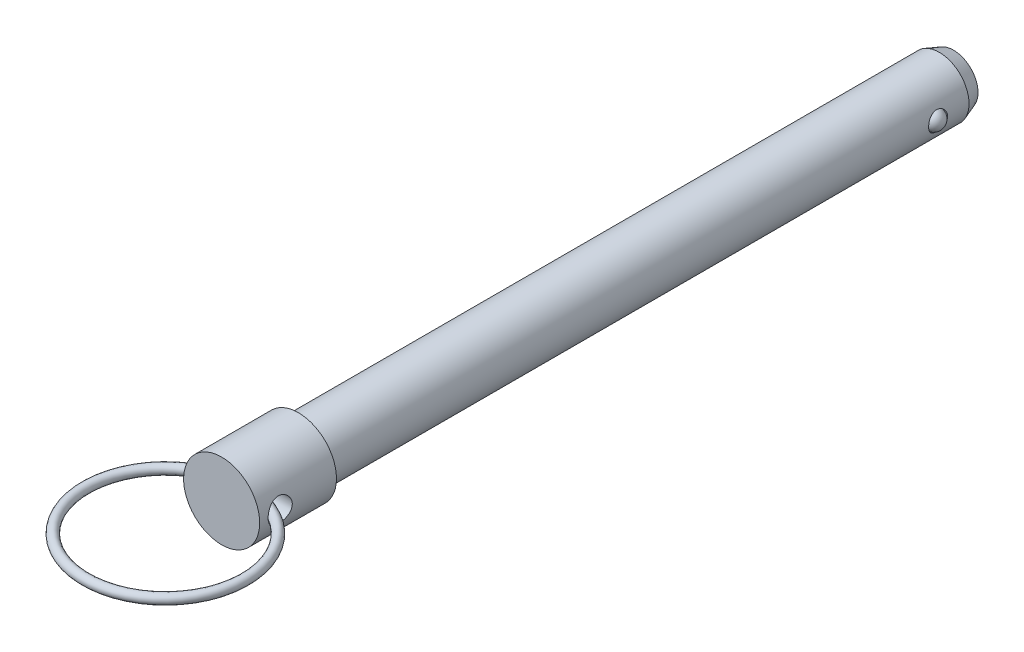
ISO-10303-21;
HEADER;
FILE_DESCRIPTION(('STEP AP214'),'2;1');
FILE_NAME('part.step','',(''),(''),'','','');
FILE_SCHEMA(('AUTOMOTIVE_DESIGN { 1 0 10303 214 1 1 1 1 }'));
ENDSEC;
DATA;
#1=APPLICATION_CONTEXT('core data for automotive mechanical design processes');
#2=APPLICATION_PROTOCOL_DEFINITION('international standard','automotive_design',2000,#1);
#3=PRODUCT_CONTEXT('',#1,'mechanical');
#4=PRODUCT('Part','Part','',(#3));
#5=PRODUCT_RELATED_PRODUCT_CATEGORY('part','',(#4));
#6=PRODUCT_DEFINITION_FORMATION('','',#4);
#7=PRODUCT_DEFINITION_CONTEXT('part definition',#1,'design');
#8=PRODUCT_DEFINITION('design','',#6,#7);
#9=PRODUCT_DEFINITION_SHAPE('','',#8);
#10=(LENGTH_UNIT() NAMED_UNIT(*) SI_UNIT(.MILLI.,.METRE.));
#11=(NAMED_UNIT(*) PLANE_ANGLE_UNIT() SI_UNIT($,.RADIAN.));
#12=(NAMED_UNIT(*) SI_UNIT($,.STERADIAN.) SOLID_ANGLE_UNIT());
#13=UNCERTAINTY_MEASURE_WITH_UNIT(LENGTH_MEASURE(1.E-05),#10,'distance_accuracy_value','');
#14=(GEOMETRIC_REPRESENTATION_CONTEXT(3) GLOBAL_UNCERTAINTY_ASSIGNED_CONTEXT((#13)) GLOBAL_UNIT_ASSIGNED_CONTEXT((#10,
#11,#12)) REPRESENTATION_CONTEXT('',''));
#15=CARTESIAN_POINT('',(0.,0.,0.));
#16=DIRECTION('',(0.,0.,1.));
#17=DIRECTION('',(1.,0.,0.));
#18=AXIS2_PLACEMENT_3D('',#15,#16,#17);
#19=CARTESIAN_POINT('',(7.9375,0.,9.398));
#20=DIRECTION('',(-1.,0.,0.));
#21=DIRECTION('',(0.,0.,-1.));
#22=AXIS2_PLACEMENT_3D('',#19,#20,#21);
#23=CYLINDRICAL_SURFACE('',#22,2.0193);
#24=CARTESIAN_POINT('',(-6.3502,0.292157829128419,11.3960531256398));
#25=CARTESIAN_POINT('',(-6.33446408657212,0.262361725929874,11.4004344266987));
#26=CARTESIAN_POINT('',(-6.32102794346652,0.231225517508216,11.4042829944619));
#27=CARTESIAN_POINT('',(-6.29925234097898,0.16715215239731,11.4106204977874));
#28=CARTESIAN_POINT('',(-6.29090461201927,0.134218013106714,11.413111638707));
#29=CARTESIAN_POINT('',(-6.27972917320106,0.0672091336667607,11.4164621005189));
#30=CARTESIAN_POINT('',(-6.27692077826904,0.0331308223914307,11.4173157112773));
#31=CARTESIAN_POINT('',(-6.27702601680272,-0.0350157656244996,11.4172838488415));
#32=CARTESIAN_POINT('',(-6.27993956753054,-0.0690840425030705,11.4163984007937));
#33=CARTESIAN_POINT('',(-6.2912662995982,-0.13574807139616,11.4130038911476));
#34=CARTESIAN_POINT('',(-6.29960976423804,-0.168356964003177,11.4105154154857));
#35=CARTESIAN_POINT('',(-6.321278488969,-0.231802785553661,11.404211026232));
#36=CARTESIAN_POINT('',(-6.33461136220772,-0.262636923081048,11.4003930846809));
#37=CARTESIAN_POINT('',(-6.3502,-0.292157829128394,11.3960531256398));
#38=B_SPLINE_CURVE_WITH_KNOTS('',3,(#24,#25,#26,#27,#28,#29,#30,#31,#32,#33,#34,#35,#36,#37),
.UNSPECIFIED.,.F.,.F.,(4,2,2,2,2,2,4),(0.,0.101899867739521,0.203633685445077,0.305721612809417,
0.407808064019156,0.50860898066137,0.609564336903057),.UNSPECIFIED.);
#39=CARTESIAN_POINT('',(-6.34383491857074,0.279747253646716,11.3978284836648));
#40=VERTEX_POINT('',#39);
#41=CARTESIAN_POINT('',(-6.34383491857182,-0.279747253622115,11.3978284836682));
#42=VERTEX_POINT('',#41);
#43=EDGE_CURVE('E40',#40,#42,#38,.T.);
#44=ORIENTED_EDGE('',*,*,#43,.F.);
#45=CARTESIAN_POINT('',(-6.35,0.,11.4173));
#46=CARTESIAN_POINT('',(-6.34999578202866,-0.110312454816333,11.417293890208));
#47=CARTESIAN_POINT('',(-6.34709412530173,-0.220741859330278,11.4082188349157));
#48=CARTESIAN_POINT('',(-6.33578529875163,-0.43847712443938,11.3722159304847));
#49=CARTESIAN_POINT('',(-6.32736871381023,-0.545777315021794,11.3452575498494));
#50=CARTESIAN_POINT('',(-6.30595235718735,-0.753914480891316,11.2744960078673));
#51=CARTESIAN_POINT('',(-6.29296259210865,-0.854765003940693,11.2307296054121));
#52=CARTESIAN_POINT('',(-6.26374009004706,-1.04765917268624,11.1277235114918));
#53=CARTESIAN_POINT('',(-6.24750783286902,-1.13970411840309,11.0684861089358));
#54=CARTESIAN_POINT('',(-6.21293601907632,-1.31536123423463,10.9342184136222));
#55=CARTESIAN_POINT('',(-6.19454917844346,-1.39865352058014,10.8587818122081));
#56=CARTESIAN_POINT('',(-6.15801023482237,-1.55164747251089,10.6951184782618));
#57=CARTESIAN_POINT('',(-6.13985819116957,-1.62134576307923,10.6068885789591));
#58=CARTESIAN_POINT('',(-6.10533720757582,-1.74691684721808,10.4173629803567));
#59=CARTESIAN_POINT('',(-6.08902613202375,-1.80238797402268,10.3157896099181));
#60=CARTESIAN_POINT('',(-6.06074349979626,-1.89532725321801,10.104153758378));
#61=CARTESIAN_POINT('',(-6.04877073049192,-1.93280043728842,9.99409365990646));
#62=CARTESIAN_POINT('',(-6.03101341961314,-1.98750760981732,9.77220930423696));
#63=CARTESIAN_POINT('',(-6.02504825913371,-2.0053339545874,9.66054596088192));
#64=CARTESIAN_POINT('',(-6.01944581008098,-2.02209234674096,9.43566621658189));
#65=CARTESIAN_POINT('',(-6.01980677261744,-2.02102961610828,9.32245025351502));
#66=CARTESIAN_POINT('',(-6.02665663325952,-2.0005025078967,9.10261826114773));
#67=CARTESIAN_POINT('',(-6.03289303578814,-1.98179631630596,8.99592223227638));
#68=CARTESIAN_POINT('',(-6.05038018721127,-1.92774435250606,8.78726894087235));
#69=CARTESIAN_POINT('',(-6.06163151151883,-1.89239667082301,8.68531222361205));
#70=CARTESIAN_POINT('',(-6.08807105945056,-1.80553890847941,8.48724541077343));
#71=CARTESIAN_POINT('',(-6.10331592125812,-1.75379385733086,8.39124624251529));
#72=CARTESIAN_POINT('',(-6.13599834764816,-1.63577635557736,8.20905256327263));
#73=CARTESIAN_POINT('',(-6.1534363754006,-1.56950083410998,8.12286013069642));
#74=CARTESIAN_POINT('',(-6.18954615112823,-1.42061516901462,7.95845350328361));
#75=CARTESIAN_POINT('',(-6.20823733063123,-1.33738288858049,7.88080597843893));
#76=CARTESIAN_POINT('',(-6.24403204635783,-1.1588116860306,7.74040227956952));
#77=CARTESIAN_POINT('',(-6.26113489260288,-1.06346754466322,7.6776525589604));
#78=CARTESIAN_POINT('',(-6.29201953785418,-0.862230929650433,7.56842117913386));
#79=CARTESIAN_POINT('',(-6.30576997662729,-0.756251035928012,7.52209142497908));
#80=CARTESIAN_POINT('',(-6.32815272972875,-0.537579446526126,7.44816775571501));
#81=CARTESIAN_POINT('',(-6.33679555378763,-0.424902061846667,7.42053535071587));
#82=CARTESIAN_POINT('',(-6.34491251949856,-0.259333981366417,7.39474486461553));
#83=CARTESIAN_POINT('',(-6.34681481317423,-0.207677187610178,7.38873516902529));
#84=CARTESIAN_POINT('',(-6.34935954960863,-0.104022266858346,7.38071129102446));
#85=CARTESIAN_POINT('',(-6.35000198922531,-0.052024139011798,7.37869711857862));
#86=CARTESIAN_POINT('',(-6.34999578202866,0.1103124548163,7.37870610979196));
#87=CARTESIAN_POINT('',(-6.34709412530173,0.220741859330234,7.38778116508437));
#88=CARTESIAN_POINT('',(-6.33578529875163,0.438477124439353,7.42378406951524));
#89=CARTESIAN_POINT('',(-6.32736871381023,0.545777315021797,7.45074245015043));
#90=CARTESIAN_POINT('',(-6.30595235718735,0.753914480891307,7.5215039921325));
#91=CARTESIAN_POINT('',(-6.29296259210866,0.854765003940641,7.5652703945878));
#92=CARTESIAN_POINT('',(-6.26374009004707,1.04765917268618,7.66827648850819));
#93=CARTESIAN_POINT('',(-6.24750783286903,1.13970411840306,7.72751389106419));
#94=CARTESIAN_POINT('',(-6.21293601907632,1.31536123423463,7.86178158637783));
#95=CARTESIAN_POINT('',(-6.19454917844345,1.39865352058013,7.93721818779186));
#96=CARTESIAN_POINT('',(-6.15801023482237,1.55164747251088,8.10088152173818));
#97=CARTESIAN_POINT('',(-6.13985819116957,1.62134576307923,8.18911142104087));
#98=CARTESIAN_POINT('',(-6.10533720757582,1.74691684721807,8.37863701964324));
#99=CARTESIAN_POINT('',(-6.08902613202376,1.80238797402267,8.48021039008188));
#100=CARTESIAN_POINT('',(-6.06074349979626,1.895327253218,8.69184624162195));
#101=CARTESIAN_POINT('',(-6.04877073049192,1.93280043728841,8.80190634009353));
#102=CARTESIAN_POINT('',(-6.03101341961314,1.98750760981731,9.02379069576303));
#103=CARTESIAN_POINT('',(-6.02504825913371,2.00533395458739,9.13545403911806));
#104=CARTESIAN_POINT('',(-6.01944581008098,2.02209234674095,9.36033378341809));
#105=CARTESIAN_POINT('',(-6.01980677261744,2.02102961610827,9.47354974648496));
#106=CARTESIAN_POINT('',(-6.02665663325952,2.00050250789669,9.69338173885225));
#107=CARTESIAN_POINT('',(-6.03289303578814,1.98179631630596,9.8000777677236));
#108=CARTESIAN_POINT('',(-6.05038018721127,1.92774435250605,10.0087310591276));
#109=CARTESIAN_POINT('',(-6.06163151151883,1.892396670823,10.1106877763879));
#110=CARTESIAN_POINT('',(-6.08807105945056,1.8055389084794,10.3087545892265));
#111=CARTESIAN_POINT('',(-6.10331592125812,1.75379385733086,10.4047537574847));
#112=CARTESIAN_POINT('',(-6.13599834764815,1.63577635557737,10.5869474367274));
#113=CARTESIAN_POINT('',(-6.1534363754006,1.56950083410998,10.6731398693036));
#114=CARTESIAN_POINT('',(-6.18954615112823,1.42061516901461,10.8375464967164));
#115=CARTESIAN_POINT('',(-6.20823733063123,1.33738288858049,10.9151940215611));
#116=CARTESIAN_POINT('',(-6.24403204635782,1.1588116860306,11.0555977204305));
#117=CARTESIAN_POINT('',(-6.26113489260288,1.06346754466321,11.1183474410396));
#118=CARTESIAN_POINT('',(-6.29201953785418,0.862230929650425,11.2275788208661));
#119=CARTESIAN_POINT('',(-6.30576997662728,0.756251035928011,11.2739085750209));
#120=CARTESIAN_POINT('',(-6.32815272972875,0.537579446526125,11.347832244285));
#121=CARTESIAN_POINT('',(-6.33679555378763,0.42490206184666,11.3754646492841));
#122=CARTESIAN_POINT('',(-6.34491251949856,0.259333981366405,11.4012551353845));
#123=CARTESIAN_POINT('',(-6.34681481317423,0.207677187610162,11.4072648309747));
#124=CARTESIAN_POINT('',(-6.34935954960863,0.104022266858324,11.4152887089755));
#125=CARTESIAN_POINT('',(-6.35000198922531,0.0520241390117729,11.4173028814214));
#126=CARTESIAN_POINT('',(-6.35,0.,11.4173));
#127=B_SPLINE_CURVE_WITH_KNOTS('',3,(#45,#46,#47,#48,#49,#50,#51,#52,#53,#54,#55,#56,#57,#58,
#59,#60,#61,#62,#63,#64,#65,#66,#67,#68,#69,#70,#71,#72,#73,#74,#75,#76,#77,#78,#79,#80,#81,#82,
#83,#84,#85,#86,#87,#88,#89,#90,#91,#92,#93,#94,#95,#96,#97,#98,#99,#100,#101,#102,#103,#104,
#105,#106,#107,#108,#109,#110,#111,#112,#113,#114,#115,#116,#117,#118,#119,#120,#121,#122,#123,
#124,#125,#126),.UNSPECIFIED.,.T.,.F.,(4,2,2,2,2,2,2,2,2,2,2,2,2,2,2,2,2,2,2,2,2,2,2,2,2,2,2,2,
2,2,2,2,2,2,2,2,2,2,2,2,4),(0.,0.33073688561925,0.662039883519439,0.992622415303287,
1.32315606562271,1.66322530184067,2.0033788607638,2.35228054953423,2.70108463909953,
3.03905724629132,3.37693642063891,3.70092724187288,4.02495524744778,4.35385413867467,
4.68282260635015,5.02727904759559,5.371884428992,5.71959937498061,6.0665963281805,
6.22257380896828,6.37855167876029,6.70928856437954,7.04059156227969,7.37117409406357,
7.70170774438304,8.04177698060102,8.38193053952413,8.73083222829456,9.07963631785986,
9.41760892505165,9.75548809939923,10.0794789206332,10.4035069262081,10.732405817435,
11.0613742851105,11.4058307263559,11.7504361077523,12.0981510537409,12.4451480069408,
12.6011254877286,12.7571033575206),.UNSPECIFIED.);
#128=EDGE_CURVE('E66',#42,#40,#127,.T.);
#129=ORIENTED_EDGE('',*,*,#128,.F.);
#130=EDGE_LOOP('',(#44,#129));
#131=FACE_BOUND('',#130,.T.);
#132=CARTESIAN_POINT('',(6.3502,-0.292157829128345,11.3960531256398));
#133=CARTESIAN_POINT('',(6.33446408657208,-0.262361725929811,11.4004344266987));
#134=CARTESIAN_POINT('',(6.32102794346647,-0.231225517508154,11.4042829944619));
#135=CARTESIAN_POINT('',(6.29925234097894,-0.167152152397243,11.4106204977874));
#136=CARTESIAN_POINT('',(6.29090461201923,-0.134218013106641,11.413111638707));
#137=CARTESIAN_POINT('',(6.27972917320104,-0.0672091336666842,11.4164621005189));
#138=CARTESIAN_POINT('',(6.27692077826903,-0.0331308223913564,11.4173157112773));
#139=CARTESIAN_POINT('',(6.27702601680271,0.0350157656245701,11.4172838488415));
#140=CARTESIAN_POINT('',(6.27993956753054,0.0690840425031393,11.4163984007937));
#141=CARTESIAN_POINT('',(6.29126629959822,0.135748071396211,11.4130038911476));
#142=CARTESIAN_POINT('',(6.29960976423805,0.168356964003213,11.4105154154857));
#143=CARTESIAN_POINT('',(6.32127848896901,0.231802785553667,11.404211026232));
#144=CARTESIAN_POINT('',(6.33461136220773,0.262636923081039,11.4003930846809));
#145=CARTESIAN_POINT('',(6.3502,0.292157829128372,11.3960531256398));
#146=B_SPLINE_CURVE_WITH_KNOTS('',3,(#132,#133,#134,#135,#136,#137,#138,#139,#140,#141,#142,
#143,#144,#145),.UNSPECIFIED.,.F.,.F.,(4,2,2,2,2,2,4),(0.,0.101899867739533,0.203633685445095,
0.305721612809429,0.407808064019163,0.508608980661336,0.609564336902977),.UNSPECIFIED.);
#147=CARTESIAN_POINT('',(6.3438349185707,-0.279747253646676,11.3978284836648));
#148=VERTEX_POINT('',#147);
#149=CARTESIAN_POINT('',(6.3438349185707,0.279747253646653,11.3978284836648));
#150=VERTEX_POINT('',#149);
#151=EDGE_CURVE('E33',#148,#150,#146,.T.);
#152=ORIENTED_EDGE('',*,*,#151,.F.);
#153=CARTESIAN_POINT('',(6.35,0.,7.3787));
#154=CARTESIAN_POINT('',(6.34999578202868,-0.110312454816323,7.37870610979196));
#155=CARTESIAN_POINT('',(6.3470941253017,-0.220741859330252,7.38778116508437));
#156=CARTESIAN_POINT('',(6.33578529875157,-0.438477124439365,7.42378406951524));
#157=CARTESIAN_POINT('',(6.32736871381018,-0.545777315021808,7.45074245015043));
#158=CARTESIAN_POINT('',(6.30595235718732,-0.753914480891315,7.5215039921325));
#159=CARTESIAN_POINT('',(6.29296259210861,-0.854765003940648,7.5652703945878));
#160=CARTESIAN_POINT('',(6.26374009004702,-1.04765917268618,7.66827648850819));
#161=CARTESIAN_POINT('',(6.24750783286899,-1.13970411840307,7.72751389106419));
#162=CARTESIAN_POINT('',(6.21293601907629,-1.31536123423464,7.86178158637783));
#163=CARTESIAN_POINT('',(6.19454917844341,-1.39865352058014,7.93721818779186));
#164=CARTESIAN_POINT('',(6.15801023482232,-1.55164747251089,8.10088152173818));
#165=CARTESIAN_POINT('',(6.13985819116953,-1.62134576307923,8.18911142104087));
#166=CARTESIAN_POINT('',(6.10533720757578,-1.74691684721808,8.37863701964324));
#167=CARTESIAN_POINT('',(6.08902613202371,-1.80238797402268,8.48021039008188));
#168=CARTESIAN_POINT('',(6.06074349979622,-1.895327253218,8.69184624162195));
#169=CARTESIAN_POINT('',(6.04877073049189,-1.93280043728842,8.80190634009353));
#170=CARTESIAN_POINT('',(6.03101341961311,-1.98750760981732,9.02379069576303));
#171=CARTESIAN_POINT('',(6.02504825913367,-2.0053339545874,9.13545403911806));
#172=CARTESIAN_POINT('',(6.01944581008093,-2.02209234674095,9.36033378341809));
#173=CARTESIAN_POINT('',(6.0198067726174,-2.02102961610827,9.47354974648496));
#174=CARTESIAN_POINT('',(6.02665663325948,-2.00050250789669,9.69338173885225));
#175=CARTESIAN_POINT('',(6.0328930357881,-1.98179631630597,9.8000777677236));
#176=CARTESIAN_POINT('',(6.05038018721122,-1.92774435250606,10.0087310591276));
#177=CARTESIAN_POINT('',(6.06163151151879,-1.89239667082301,10.1106877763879));
#178=CARTESIAN_POINT('',(6.08807105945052,-1.80553890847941,10.3087545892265));
#179=CARTESIAN_POINT('',(6.10331592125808,-1.75379385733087,10.4047537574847));
#180=CARTESIAN_POINT('',(6.13599834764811,-1.63577635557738,10.5869474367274));
#181=CARTESIAN_POINT('',(6.15343637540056,-1.56950083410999,10.6731398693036));
#182=CARTESIAN_POINT('',(6.18954615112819,-1.42061516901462,10.8375464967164));
#183=CARTESIAN_POINT('',(6.20823733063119,-1.3373828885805,10.9151940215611));
#184=CARTESIAN_POINT('',(6.24403204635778,-1.1588116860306,11.0555977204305));
#185=CARTESIAN_POINT('',(6.26113489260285,-1.06346754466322,11.1183474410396));
#186=CARTESIAN_POINT('',(6.29201953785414,-0.862230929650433,11.2275788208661));
#187=CARTESIAN_POINT('',(6.30576997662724,-0.756251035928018,11.2739085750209));
#188=CARTESIAN_POINT('',(6.3281527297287,-0.537579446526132,11.347832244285));
#189=CARTESIAN_POINT('',(6.3367955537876,-0.424902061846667,11.3754646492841));
#190=CARTESIAN_POINT('',(6.34491251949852,-0.259333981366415,11.4012551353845));
#191=CARTESIAN_POINT('',(6.34681481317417,-0.207677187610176,11.4072648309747));
#192=CARTESIAN_POINT('',(6.34935954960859,-0.104022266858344,11.4152887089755));
#193=CARTESIAN_POINT('',(6.3500019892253,-0.0520241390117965,11.4173028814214));
#194=CARTESIAN_POINT('',(6.34999578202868,0.110312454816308,11.417293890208));
#195=CARTESIAN_POINT('',(6.3470941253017,0.220741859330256,11.4082188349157));
#196=CARTESIAN_POINT('',(6.33578529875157,0.438477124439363,11.3722159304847));
#197=CARTESIAN_POINT('',(6.32736871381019,0.545777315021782,11.3452575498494));
#198=CARTESIAN_POINT('',(6.30595235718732,0.753914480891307,11.2744960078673));
#199=CARTESIAN_POINT('',(6.2929625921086,0.854765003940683,11.2307296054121));
#200=CARTESIAN_POINT('',(6.26374009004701,1.04765917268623,11.1277235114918));
#201=CARTESIAN_POINT('',(6.24750783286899,1.13970411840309,11.0684861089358));
#202=CARTESIAN_POINT('',(6.21293601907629,1.31536123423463,10.9342184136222));
#203=CARTESIAN_POINT('',(6.19454917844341,1.39865352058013,10.8587818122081));
#204=CARTESIAN_POINT('',(6.15801023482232,1.55164747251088,10.6951184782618));
#205=CARTESIAN_POINT('',(6.13985819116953,1.62134576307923,10.6068885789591));
#206=CARTESIAN_POINT('',(6.10533720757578,1.74691684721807,10.4173629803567));
#207=CARTESIAN_POINT('',(6.08902613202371,1.80238797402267,10.3157896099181));
#208=CARTESIAN_POINT('',(6.06074349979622,1.895327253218,10.104153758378));
#209=CARTESIAN_POINT('',(6.04877073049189,1.93280043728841,9.99409365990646));
#210=CARTESIAN_POINT('',(6.03101341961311,1.98750760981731,9.77220930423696));
#211=CARTESIAN_POINT('',(6.02504825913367,2.00533395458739,9.66054596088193));
#212=CARTESIAN_POINT('',(6.01944581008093,2.02209234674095,9.43566621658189));
#213=CARTESIAN_POINT('',(6.0198067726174,2.02102961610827,9.32245025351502));
#214=CARTESIAN_POINT('',(6.02665663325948,2.00050250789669,9.10261826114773));
#215=CARTESIAN_POINT('',(6.0328930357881,1.98179631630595,8.99592223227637));
#216=CARTESIAN_POINT('',(6.05038018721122,1.92774435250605,8.78726894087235));
#217=CARTESIAN_POINT('',(6.06163151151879,1.89239667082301,8.68531222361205));
#218=CARTESIAN_POINT('',(6.08807105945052,1.80553890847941,8.48724541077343));
#219=CARTESIAN_POINT('',(6.10331592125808,1.75379385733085,8.39124624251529));
#220=CARTESIAN_POINT('',(6.13599834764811,1.63577635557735,8.20905256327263));
#221=CARTESIAN_POINT('',(6.15343637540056,1.56950083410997,8.12286013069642));
#222=CARTESIAN_POINT('',(6.18954615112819,1.42061516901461,7.95845350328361));
#223=CARTESIAN_POINT('',(6.20823733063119,1.33738288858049,7.88080597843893));
#224=CARTESIAN_POINT('',(6.24403204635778,1.1588116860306,7.74040227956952));
#225=CARTESIAN_POINT('',(6.26113489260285,1.06346754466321,7.6776525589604));
#226=CARTESIAN_POINT('',(6.29201953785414,0.862230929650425,7.56842117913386));
#227=CARTESIAN_POINT('',(6.30576997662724,0.756251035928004,7.52209142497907));
#228=CARTESIAN_POINT('',(6.32815272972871,0.53757944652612,7.44816775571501));
#229=CARTESIAN_POINT('',(6.3367955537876,0.424902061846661,7.42053535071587));
#230=CARTESIAN_POINT('',(6.34491251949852,0.259333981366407,7.39474486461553));
#231=CARTESIAN_POINT('',(6.34681481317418,0.207677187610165,7.38873516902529));
#232=CARTESIAN_POINT('',(6.34935954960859,0.104022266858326,7.38071129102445));
#233=CARTESIAN_POINT('',(6.3500019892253,0.0520241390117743,7.37869711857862));
#234=CARTESIAN_POINT('',(6.35,0.,7.3787));
#235=B_SPLINE_CURVE_WITH_KNOTS('',3,(#153,#154,#155,#156,#157,#158,#159,#160,#161,#162,#163,
#164,#165,#166,#167,#168,#169,#170,#171,#172,#173,#174,#175,#176,#177,#178,#179,#180,#181,#182,
#183,#184,#185,#186,#187,#188,#189,#190,#191,#192,#193,#194,#195,#196,#197,#198,#199,#200,#201,
#202,#203,#204,#205,#206,#207,#208,#209,#210,#211,#212,#213,#214,#215,#216,#217,#218,#219,#220,
#221,#222,#223,#224,#225,#226,#227,#228,#229,#230,#231,#232,#233,#234),.UNSPECIFIED.,.T.,.F.,(4,
2,2,2,2,2,2,2,2,2,2,2,2,2,2,2,2,2,2,2,2,2,2,2,2,2,2,2,2,2,2,2,2,2,2,2,2,2,2,2,4),(0.,
0.330736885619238,0.662039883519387,0.992622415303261,1.32315606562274,1.66322530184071,
2.00337886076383,2.35228054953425,2.70108463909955,3.03905724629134,3.37693642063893,
3.70092724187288,4.02495524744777,4.35385413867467,4.68282260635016,5.02727904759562,
5.37188442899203,5.71959937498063,6.06659632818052,6.22257380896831,6.37855167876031,
6.70928856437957,7.04059156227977,7.37117409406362,7.70170774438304,8.04177698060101,
8.38193053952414,8.73083222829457,9.07963631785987,9.41760892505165,9.75548809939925,
10.0794789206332,10.4035069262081,10.732405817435,11.0613742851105,11.4058307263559,
11.7504361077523,12.0981510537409,12.4451480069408,12.6011254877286,12.7571033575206),.UNSPECIFIED.);
#236=EDGE_CURVE('E62',#150,#148,#235,.T.);
#237=ORIENTED_EDGE('',*,*,#236,.F.);
#238=EDGE_LOOP('',(#152,#237));
#239=FACE_BOUND('',#238,.T.);
#240=ADVANCED_FACE('F14',(#131,#239),#23,.F.);
#241=CARTESIAN_POINT('',(0.,0.,-34.39922));
#242=DIRECTION('',(0.,0.,-1.));
#243=DIRECTION('',(1.,0.,0.));
#244=AXIS2_PLACEMENT_3D('',#241,#242,#243);
#245=CYLINDRICAL_SURFACE('',#244,6.35);
#246=ORIENTED_EDGE('',*,*,#236,.T.);
#247=CARTESIAN_POINT('',(6.34665582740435,-0.206057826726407,9.66636736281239));
#248=CARTESIAN_POINT('',(6.34528498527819,-0.248279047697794,9.67828523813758));
#249=CARTESIAN_POINT('',(6.34352249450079,-0.289459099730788,9.69386090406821));
#250=CARTESIAN_POINT('',(6.33942011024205,-0.368543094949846,9.73178017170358));
#251=CARTESIAN_POINT('',(6.33708008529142,-0.406446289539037,9.75412531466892));
#252=CARTESIAN_POINT('',(6.3320924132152,-0.477899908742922,9.80476660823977));
#253=CARTESIAN_POINT('',(6.32944535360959,-0.511458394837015,9.83305147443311));
#254=CARTESIAN_POINT('',(6.32412241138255,-0.573540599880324,9.89467297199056));
#255=CARTESIAN_POINT('',(6.32144652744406,-0.602064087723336,9.92800983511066));
#256=CARTESIAN_POINT('',(6.31623478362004,-0.654523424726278,10.0000464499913));
#257=CARTESIAN_POINT('',(6.31370785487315,-0.678248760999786,10.0388997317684));
#258=CARTESIAN_POINT('',(6.30914807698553,-0.719430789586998,10.1198151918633));
#259=CARTESIAN_POINT('',(6.30711537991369,-0.736885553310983,10.1618783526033));
#260=CARTESIAN_POINT('',(6.30356963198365,-0.766652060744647,10.2517585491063));
#261=CARTESIAN_POINT('',(6.30211474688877,-0.778407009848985,10.2997618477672));
#262=CARTESIAN_POINT('',(6.30009638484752,-0.794575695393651,10.3969997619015));
#263=CARTESIAN_POINT('',(6.29953326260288,-0.798986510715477,10.4462348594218));
#264=CARTESIAN_POINT('',(6.29930439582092,-0.800791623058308,10.5499764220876));
#265=CARTESIAN_POINT('',(6.29973840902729,-0.797405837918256,10.6044969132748));
#266=CARTESIAN_POINT('',(6.3016277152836,-0.782332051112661,10.7123814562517));
#267=CARTESIAN_POINT('',(6.30308376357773,-0.770637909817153,10.7657446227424));
#268=CARTESIAN_POINT('',(6.30699495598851,-0.737976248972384,10.8743575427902));
#269=CARTESIAN_POINT('',(6.30952256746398,-0.716323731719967,10.9294001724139));
#270=CARTESIAN_POINT('',(6.31524450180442,-0.663986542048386,11.0349896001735));
#271=CARTESIAN_POINT('',(6.31843852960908,-0.633305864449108,11.0855383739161));
#272=CARTESIAN_POINT('',(6.32446092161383,-0.569663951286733,11.1714846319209));
#273=CARTESIAN_POINT('',(6.32724886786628,-0.538153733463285,11.2079604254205));
#274=CARTESIAN_POINT('',(6.33270636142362,-0.469583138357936,11.2752665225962));
#275=CARTESIAN_POINT('',(6.33537605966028,-0.43253011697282,11.3061041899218));
#276=CARTESIAN_POINT('',(6.33987873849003,-0.359908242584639,11.3561064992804));
#277=CARTESIAN_POINT('',(6.34177713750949,-0.325092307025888,11.3763560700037));
#278=CARTESIAN_POINT('',(6.34507913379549,-0.252556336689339,11.4108259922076));
#279=CARTESIAN_POINT('',(6.34648300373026,-0.214837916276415,11.4250496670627));
#280=CARTESIAN_POINT('',(6.34863622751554,-0.137224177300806,11.4466382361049));
#281=CARTESIAN_POINT('',(6.34938200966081,-0.0973182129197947,11.4539657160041));
#282=CARTESIAN_POINT('',(6.35010496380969,-0.0168334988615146,11.4610716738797));
#283=CARTESIAN_POINT('',(6.35008242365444,0.0237449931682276,11.4608529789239));
#284=CARTESIAN_POINT('',(6.34931136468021,0.100393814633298,11.4532686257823));
#285=CARTESIAN_POINT('',(6.34863038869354,0.136533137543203,11.4465678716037));
#286=CARTESIAN_POINT('',(6.34671646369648,0.207223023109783,11.4274006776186));
#287=CARTESIAN_POINT('',(6.34548344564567,0.241773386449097,11.4149335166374));
#288=CARTESIAN_POINT('',(6.34254165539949,0.309606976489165,11.3844132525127));
#289=CARTESIAN_POINT('',(6.34081891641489,0.342814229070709,11.366194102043));
#290=CARTESIAN_POINT('',(6.33707366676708,0.40621157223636,11.3251453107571));
#291=CARTESIAN_POINT('',(6.33505103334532,0.436400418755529,11.3023137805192));
#292=CARTESIAN_POINT('',(6.33055131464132,0.497695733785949,11.2491439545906));
#293=CARTESIAN_POINT('',(6.32805141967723,0.528268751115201,11.2181940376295));
#294=CARTESIAN_POINT('',(6.32308163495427,0.584759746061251,11.1523092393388));
#295=CARTESIAN_POINT('',(6.32061176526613,0.610674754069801,11.1173718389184));
#296=CARTESIAN_POINT('',(6.31545647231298,0.662038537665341,11.0376631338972));
#297=CARTESIAN_POINT('',(6.31281513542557,0.68652229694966,10.992265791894));
#298=CARTESIAN_POINT('',(6.30810097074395,0.728566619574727,10.8983369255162));
#299=CARTESIAN_POINT('',(6.30602851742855,0.746122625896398,10.849803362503));
#300=CARTESIAN_POINT('',(6.30243933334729,0.775896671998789,10.7442183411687));
#301=CARTESIAN_POINT('',(6.30103001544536,0.787122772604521,10.6868803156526));
#302=CARTESIAN_POINT('',(6.29940721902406,0.800007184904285,10.5710986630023));
#303=CARTESIAN_POINT('',(6.29919407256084,0.801662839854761,10.5126547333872));
#304=CARTESIAN_POINT('',(6.30005021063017,0.794909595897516,10.395672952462));
#305=CARTESIAN_POINT('',(6.3011338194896,0.786388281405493,10.3371413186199));
#306=CARTESIAN_POINT('',(6.30452399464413,0.758730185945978,10.2226628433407));
#307=CARTESIAN_POINT('',(6.30682981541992,0.739599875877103,10.1667144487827));
#308=CARTESIAN_POINT('',(6.31212037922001,0.692916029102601,10.0644672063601));
#309=CARTESIAN_POINT('',(6.31502617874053,0.666266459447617,10.0177527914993));
#310=CARTESIAN_POINT('',(6.32122790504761,0.60459260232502,9.93024699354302));
#311=CARTESIAN_POINT('',(6.32452352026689,0.56957498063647,9.88945093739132));
#312=CARTESIAN_POINT('',(6.33066231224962,0.496394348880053,9.81967919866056));
#313=CARTESIAN_POINT('',(6.33351542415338,0.45899929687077,9.78989736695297));
#314=CARTESIAN_POINT('',(6.33878167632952,0.379383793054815,9.73763453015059));
#315=CARTESIAN_POINT('',(6.34119502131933,0.337165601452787,9.71515012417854));
#316=CARTESIAN_POINT('',(6.34510608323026,0.252558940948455,9.67976956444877));
#317=CARTESIAN_POINT('',(6.34665878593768,0.210419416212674,9.66628201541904));
#318=CARTESIAN_POINT('',(6.34892624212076,0.124425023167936,9.64681261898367));
#319=CARTESIAN_POINT('',(6.34964132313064,0.0805708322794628,9.64082783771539));
#320=CARTESIAN_POINT('',(6.35013003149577,-0.00429887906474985,9.63672685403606));
#321=CARTESIAN_POINT('',(6.34996835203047,-0.0452888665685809,9.63806999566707));
#322=CARTESIAN_POINT('',(6.34886964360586,-0.126506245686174,9.64734016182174));
#323=CARTESIAN_POINT('',(6.34793260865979,-0.166733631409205,9.65526723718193));
#324=CARTESIAN_POINT('',(6.34665582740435,-0.206057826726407,9.66636736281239));
#325=B_SPLINE_CURVE_WITH_KNOTS('',3,(#247,#248,#249,#250,#251,#252,#253,#254,#255,#256,#257,
#258,#259,#260,#261,#262,#263,#264,#265,#266,#267,#268,#269,#270,#271,#272,#273,#274,#275,#276,
#277,#278,#279,#280,#281,#282,#283,#284,#285,#286,#287,#288,#289,#290,#291,#292,#293,#294,#295,
#296,#297,#298,#299,#300,#301,#302,#303,#304,#305,#306,#307,#308,#309,#310,#311,#312,#313,#314,
#315,#316,#317,#318,#319,#320,#321,#322,#323,#324),.UNSPECIFIED.,.T.,.F.,(4,2,2,2,2,2,2,2,2,2,2,
2,2,2,2,2,2,2,2,2,2,2,2,2,2,2,2,2,2,2,2,2,2,2,2,2,2,2,4),(0.,0.131523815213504,
0.263077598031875,0.394383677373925,0.52569578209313,0.661900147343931,0.798146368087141,
0.94586459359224,1.09364155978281,1.25683680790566,1.42015277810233,1.59693202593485,
1.77363316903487,1.91791685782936,2.06201073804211,2.18247669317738,2.3028761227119,
2.4239250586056,2.54492864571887,2.65470676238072,2.76449861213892,2.87780525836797,
2.99115841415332,3.12140054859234,3.25172542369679,3.40605418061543,3.56048428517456,
3.73501068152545,3.90958552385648,4.08610670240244,4.26252033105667,4.42319186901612,
4.58373584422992,4.7266458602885,4.86948917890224,5.00164792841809,5.13375498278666,
5.25625329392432,5.37875255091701),.UNSPECIFIED.);
#326=EDGE_CURVE('E27',#148,#150,#325,.T.);
#327=ORIENTED_EDGE('',*,*,#326,.T.);
#328=EDGE_LOOP('',(#246,#327));
#329=FACE_BOUND('',#328,.T.);
#330=CARTESIAN_POINT('',(0.,0.,12.8270000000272));
#331=DIRECTION('',(0.,0.,-1.));
#332=DIRECTION('',(1.,0.,0.));
#333=AXIS2_PLACEMENT_3D('',#330,#331,#332);
#334=CIRCLE('',#333,6.34999999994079);
#335=CARTESIAN_POINT('',(6.34999999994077,0.,12.8270000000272));
#336=VERTEX_POINT('',#335);
#337=EDGE_CURVE('E71',#336,#336,#334,.T.);
#338=ORIENTED_EDGE('',*,*,#337,.T.);
#339=EDGE_LOOP('',(#338));
#340=FACE_BOUND('',#339,.T.);
#341=CARTESIAN_POINT('',(0.,0.,1.16018306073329E-11));
#342=DIRECTION('',(0.,0.,-1.));
#343=DIRECTION('',(1.,0.,0.));
#344=AXIS2_PLACEMENT_3D('',#341,#342,#343);
#345=CIRCLE('',#344,6.34999999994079);
#346=CARTESIAN_POINT('',(6.34999999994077,0.,1.16015507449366E-11));
#347=VERTEX_POINT('',#346);
#348=EDGE_CURVE('E279',#347,#347,#345,.T.);
#349=ORIENTED_EDGE('',*,*,#348,.F.);
#350=EDGE_LOOP('',(#349));
#351=FACE_BOUND('',#350,.T.);
#352=ORIENTED_EDGE('',*,*,#128,.T.);
#353=CARTESIAN_POINT('',(-6.34665582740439,-0.206057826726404,9.6663673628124));
#354=CARTESIAN_POINT('',(-6.34797934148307,-0.165285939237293,9.65485950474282));
#355=CARTESIAN_POINT('',(-6.34893816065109,-0.123532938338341,9.64675937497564));
#356=CARTESIAN_POINT('',(-6.350018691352,-0.0392395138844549,9.63764831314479));
#357=CARTESIAN_POINT('',(-6.35014017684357,0.0033011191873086,9.63663929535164));
#358=CARTESIAN_POINT('',(-6.34953206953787,0.0879394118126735,9.64174776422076));
#359=CARTESIAN_POINT('',(-6.34880260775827,0.130037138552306,9.6478641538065));
#360=CARTESIAN_POINT('',(-6.34657447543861,0.212600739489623,9.66701677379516));
#361=CARTESIAN_POINT('',(-6.34507584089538,0.253066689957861,9.68005268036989));
#362=CARTESIAN_POINT('',(-6.34146900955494,0.331381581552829,9.71266230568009));
#363=CARTESIAN_POINT('',(-6.33935898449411,0.369222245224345,9.73225566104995));
#364=CARTESIAN_POINT('',(-6.33475813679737,0.441182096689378,9.77733154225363));
#365=CARTESIAN_POINT('',(-6.33226728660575,0.475301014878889,9.80281449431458));
#366=CARTESIAN_POINT('',(-6.3270843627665,0.539990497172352,9.85971055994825));
#367=CARTESIAN_POINT('',(-6.32438850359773,0.570424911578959,9.89127784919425));
#368=CARTESIAN_POINT('',(-6.31913817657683,0.625916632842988,9.95882994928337));
#369=CARTESIAN_POINT('',(-6.31658374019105,0.650972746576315,9.99481573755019));
#370=CARTESIAN_POINT('',(-6.31170869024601,0.696703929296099,10.072488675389));
#371=CARTESIAN_POINT('',(-6.30941195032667,0.717017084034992,10.1143899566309));
#372=CARTESIAN_POINT('',(-6.30545539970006,0.751016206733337,10.2008200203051));
#373=CARTESIAN_POINT('',(-6.30379582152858,0.764699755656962,10.2453497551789));
#374=CARTESIAN_POINT('',(-6.30112261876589,0.786439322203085,10.3401349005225));
#375=CARTESIAN_POINT('',(-6.3001830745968,0.793856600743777,10.3905385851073));
#376=CARTESIAN_POINT('',(-6.29927265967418,0.801046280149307,10.491890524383));
#377=CARTESIAN_POINT('',(-6.29930218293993,0.800815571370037,10.5428389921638));
#378=CARTESIAN_POINT('',(-6.30034248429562,0.792594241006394,10.6494235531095));
#379=CARTESIAN_POINT('',(-6.3014547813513,0.783800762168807,10.704997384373));
#380=CARTESIAN_POINT('',(-6.30465473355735,0.757628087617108,10.8140964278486));
#381=CARTESIAN_POINT('',(-6.30674324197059,0.740241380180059,10.8676198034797));
#382=CARTESIAN_POINT('',(-6.31179783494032,0.695872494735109,10.9743734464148));
#383=CARTESIAN_POINT('',(-6.31480965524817,0.668369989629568,11.0273869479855));
#384=CARTESIAN_POINT('',(-6.32125797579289,0.604341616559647,11.1276207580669));
#385=CARTESIAN_POINT('',(-6.32469393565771,0.567827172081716,11.1748482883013));
#386=CARTESIAN_POINT('',(-6.33064540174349,0.496358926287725,11.2504526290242));
#387=CARTESIAN_POINT('',(-6.33317742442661,0.463272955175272,11.2805972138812));
#388=CARTESIAN_POINT('',(-6.33795112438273,0.392589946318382,11.3350975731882));
#389=CARTESIAN_POINT('',(-6.34019298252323,0.354995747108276,11.3594569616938));
#390=CARTESIAN_POINT('',(-6.34414022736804,0.275631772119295,11.4012144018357));
#391=CARTESIAN_POINT('',(-6.34584084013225,0.233828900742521,11.4185508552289));
#392=CARTESIAN_POINT('',(-6.34843013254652,0.147595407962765,11.4446164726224));
#393=CARTESIAN_POINT('',(-6.34931975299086,0.103167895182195,11.4533556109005));
#394=CARTESIAN_POINT('',(-6.3500851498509,0.0199378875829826,11.4608753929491));
#395=CARTESIAN_POINT('',(-6.35008843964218,-0.0187536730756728,11.460908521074));
#396=CARTESIAN_POINT('',(-6.34939746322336,-0.0955170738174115,11.4541183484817));
#397=CARTESIAN_POINT('',(-6.34870331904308,-0.133589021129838,11.447296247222));
#398=CARTESIAN_POINT('',(-6.34675486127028,-0.206035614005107,11.4277870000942));
#399=CARTESIAN_POINT('',(-6.34553149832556,-0.240499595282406,11.4154227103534));
#400=CARTESIAN_POINT('',(-6.34265636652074,-0.307121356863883,11.3856122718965));
#401=CARTESIAN_POINT('',(-6.34100449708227,-0.339278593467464,11.3681649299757));
#402=CARTESIAN_POINT('',(-6.33723692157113,-0.403825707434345,11.3269948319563));
#403=CARTESIAN_POINT('',(-6.33509154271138,-0.43592598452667,11.3028229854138));
#404=CARTESIAN_POINT('',(-6.33064272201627,-0.496369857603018,11.2501922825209));
#405=CARTESIAN_POINT('',(-6.32833919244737,-0.524711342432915,11.2217310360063));
#406=CARTESIAN_POINT('',(-6.3233403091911,-0.582098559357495,11.156008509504));
#407=CARTESIAN_POINT('',(-6.32064774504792,-0.61038158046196,11.1180812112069));
#408=CARTESIAN_POINT('',(-6.31552631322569,-0.661272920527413,11.0385798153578));
#409=CARTESIAN_POINT('',(-6.31309762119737,-0.683877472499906,10.9970033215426));
#410=CARTESIAN_POINT('',(-6.30833642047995,-0.726588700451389,10.903890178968));
#411=CARTESIAN_POINT('',(-6.30608942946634,-0.745628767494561,10.851857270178));
#412=CARTESIAN_POINT('',(-6.30248979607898,-0.775466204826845,10.7454330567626));
#413=CARTESIAN_POINT('',(-6.30113765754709,-0.786258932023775,10.6910404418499));
#414=CARTESIAN_POINT('',(-6.29944352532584,-0.799728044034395,10.5770263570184));
#415=CARTESIAN_POINT('',(-6.29918591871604,-0.80172680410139,10.5173211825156));
#416=CARTESIAN_POINT('',(-6.30000525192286,-0.795264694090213,10.398466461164));
#417=CARTESIAN_POINT('',(-6.30108195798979,-0.786805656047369,10.339316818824));
#418=CARTESIAN_POINT('',(-6.30440515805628,-0.759704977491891,10.2262823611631));
#419=CARTESIAN_POINT('',(-6.30659553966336,-0.741549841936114,10.1722805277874));
#420=CARTESIAN_POINT('',(-6.31185428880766,-0.695364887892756,10.0687073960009));
#421=CARTESIAN_POINT('',(-6.3149220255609,-0.667342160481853,10.0191329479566));
#422=CARTESIAN_POINT('',(-6.32113146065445,-0.605515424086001,9.9316897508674));
#423=CARTESIAN_POINT('',(-6.32422841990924,-0.572678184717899,9.89313380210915));
#424=CARTESIAN_POINT('',(-6.33035789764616,-0.500375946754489,9.82285661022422));
#425=CARTESIAN_POINT('',(-6.33339048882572,-0.460918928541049,9.79112724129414));
#426=CARTESIAN_POINT('',(-6.33833786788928,-0.386069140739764,9.74204682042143));
#427=CARTESIAN_POINT('',(-6.34035098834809,-0.351739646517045,9.72306715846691));
#428=CARTESIAN_POINT('',(-6.34389840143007,-0.280571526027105,9.69054512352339));
#429=CARTESIAN_POINT('',(-6.34543281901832,-0.243733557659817,9.67700133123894));
#430=CARTESIAN_POINT('',(-6.34665582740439,-0.206057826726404,9.6663673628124));
#431=B_SPLINE_CURVE_WITH_KNOTS('',3,(#353,#354,#355,#356,#357,#358,#359,#360,#361,#362,#363,
#364,#365,#366,#367,#368,#369,#370,#371,#372,#373,#374,#375,#376,#377,#378,#379,#380,#381,#382,
#383,#384,#385,#386,#387,#388,#389,#390,#391,#392,#393,#394,#395,#396,#397,#398,#399,#400,#401,
#402,#403,#404,#405,#406,#407,#408,#409,#410,#411,#412,#413,#414,#415,#416,#417,#418,#419,#420,
#421,#422,#423,#424,#425,#426,#427,#428,#429,#430),.UNSPECIFIED.,.T.,.F.,(4,2,2,2,2,2,2,2,2,2,2,
2,2,2,2,2,2,2,2,2,2,2,2,2,2,2,2,2,2,2,2,2,2,2,2,2,2,2,4),(0.,0.127017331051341,
0.254068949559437,0.381101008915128,0.508127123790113,0.635537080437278,0.762956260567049,
0.894175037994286,1.02542289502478,1.16470220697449,1.30403230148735,1.45626942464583,
1.60856844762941,1.77667342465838,1.94492561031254,2.12343441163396,2.30171808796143,
2.43568966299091,2.56957732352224,2.70461513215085,2.83949608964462,2.95496006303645,
3.0704038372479,3.17985460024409,3.2893310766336,3.40960027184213,3.52993673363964,
3.67156568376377,3.81328834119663,3.97894617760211,4.14469720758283,4.32301887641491,
4.5013093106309,4.67139503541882,4.84135878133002,4.99274402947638,5.14394807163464,
5.2613505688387,5.37872239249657),.UNSPECIFIED.);
#432=EDGE_CURVE('E9',#40,#42,#431,.T.);
#433=ORIENTED_EDGE('',*,*,#432,.T.);
#434=EDGE_LOOP('',(#352,#433));
#435=FACE_BOUND('',#434,.T.);
#436=ADVANCED_FACE('F64',(#329,#340,#351,#435),#245,.T.);
#437=CARTESIAN_POINT('',(0.,0.,-75.));
#438=DIRECTION('',(0.,0.,1.));
#439=DIRECTION('',(-0.810321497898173,-0.585985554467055,0.));
#440=AXIS2_PLACEMENT_3D('',#437,#438,#439);
#441=CYLINDRICAL_SURFACE('',#440,4.95554);
#442=CARTESIAN_POINT('',(0.,0.,0.));
#443=DIRECTION('',(0.,0.,-1.));
#444=DIRECTION('',(0.810321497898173,0.585985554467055,0.));
#445=AXIS2_PLACEMENT_3D('',#442,#443,#444);
#446=CIRCLE('',#445,4.95554);
#447=CARTESIAN_POINT('',(4.01558059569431,2.90387485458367,0.));
#448=VERTEX_POINT('',#447);
#449=EDGE_CURVE('E60',#448,#448,#446,.T.);
#450=ORIENTED_EDGE('',*,*,#449,.T.);
#451=EDGE_LOOP('',(#450));
#452=FACE_BOUND('',#451,.T.);
#453=CARTESIAN_POINT('',(4.95554,0.,-100.29332));
#454=CARTESIAN_POINT('',(4.95553666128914,0.0866897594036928,-100.293324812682));
#455=CARTESIAN_POINT('',(4.95324045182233,0.173471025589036,-100.300453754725));
#456=CARTESIAN_POINT('',(4.94429120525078,0.344577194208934,-100.328734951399));
#457=CARTESIAN_POINT('',(4.93763074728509,0.428897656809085,-100.349911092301));
#458=CARTESIAN_POINT('',(4.92068254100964,0.592457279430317,-100.405492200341));
#459=CARTESIAN_POINT('',(4.91040277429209,0.67170717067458,-100.439868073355));
#460=CARTESIAN_POINT('',(4.88727518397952,0.823288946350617,-100.520770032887));
#461=CARTESIAN_POINT('',(4.87442773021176,0.895621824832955,-100.567294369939));
#462=CARTESIAN_POINT('',(4.84705629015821,1.03369400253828,-100.672764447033));
#463=CARTESIAN_POINT('',(4.83249427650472,1.09917878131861,-100.732033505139));
#464=CARTESIAN_POINT('',(4.80355063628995,1.21947281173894,-100.860625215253));
#465=CARTESIAN_POINT('',(4.78916905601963,1.27427937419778,-100.929950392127));
#466=CARTESIAN_POINT('',(4.76180578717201,1.37305673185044,-101.078908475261));
#467=CARTESIAN_POINT('',(4.74887057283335,1.41670648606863,-101.158763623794));
#468=CARTESIAN_POINT('',(4.72643603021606,1.48985016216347,-101.325162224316));
#469=CARTESIAN_POINT('',(4.71693572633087,1.51934810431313,-101.4117037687));
#470=CARTESIAN_POINT('',(4.70284355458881,1.56241523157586,-101.586150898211));
#471=CARTESIAN_POINT('',(4.6981066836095,1.57645629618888,-101.673927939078));
#472=CARTESIAN_POINT('',(4.69364777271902,1.58968567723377,-101.850709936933));
#473=CARTESIAN_POINT('',(4.69392432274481,1.58887816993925,-101.939714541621));
#474=CARTESIAN_POINT('',(4.69933334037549,1.5728014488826,-102.11247716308));
#475=CARTESIAN_POINT('',(4.7042624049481,1.55813797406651,-102.196299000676));
#476=CARTESIAN_POINT('',(4.71808978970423,1.51574977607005,-102.360224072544));
#477=CARTESIAN_POINT('',(4.7269885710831,1.48802353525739,-102.44032687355));
#478=CARTESIAN_POINT('',(4.74790477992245,1.41987997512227,-102.595959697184));
#479=CARTESIAN_POINT('',(4.75996755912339,1.37927613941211,-102.671401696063));
#480=CARTESIAN_POINT('',(4.78583160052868,1.28666181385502,-102.814593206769));
#481=CARTESIAN_POINT('',(4.79963323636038,1.23464887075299,-102.882341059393));
#482=CARTESIAN_POINT('',(4.82822844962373,1.11775274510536,-103.011632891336));
#483=CARTESIAN_POINT('',(4.84303789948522,1.05237301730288,-103.072725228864));
#484=CARTESIAN_POINT('',(4.87140539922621,0.912085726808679,-103.183213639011));
#485=CARTESIAN_POINT('',(4.88496290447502,0.837174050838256,-103.232604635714));
#486=CARTESIAN_POINT('',(4.90945634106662,0.679024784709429,-103.31861719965));
#487=CARTESIAN_POINT('',(4.92036685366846,0.595716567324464,-103.355116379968));
#488=CARTESIAN_POINT('',(4.93813643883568,0.423802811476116,-103.41338333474));
#489=CARTESIAN_POINT('',(4.94500382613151,0.335208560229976,-103.435181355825));
#490=CARTESIAN_POINT('',(4.95147275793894,0.204839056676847,-103.455586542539));
#491=CARTESIAN_POINT('',(4.9529935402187,0.164038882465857,-103.460355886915));
#492=CARTESIAN_POINT('',(4.9550279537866,0.0821659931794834,-103.46672376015));
#493=CARTESIAN_POINT('',(4.95554158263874,0.0410932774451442,-103.468322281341));
#494=CARTESIAN_POINT('',(4.95553666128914,-0.0866897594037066,-103.468315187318));
#495=CARTESIAN_POINT('',(4.95324045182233,-0.173471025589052,-103.461186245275));
#496=CARTESIAN_POINT('',(4.94429120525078,-0.344577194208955,-103.432905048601));
#497=CARTESIAN_POINT('',(4.93763074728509,-0.428897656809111,-103.411728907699));
#498=CARTESIAN_POINT('',(4.92068254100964,-0.592457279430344,-103.356147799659));
#499=CARTESIAN_POINT('',(4.91040277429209,-0.671707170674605,-103.321771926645));
#500=CARTESIAN_POINT('',(4.88727518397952,-0.823288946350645,-103.240869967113));
#501=CARTESIAN_POINT('',(4.87442773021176,-0.895621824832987,-103.194345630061));
#502=CARTESIAN_POINT('',(4.84705629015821,-1.03369400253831,-103.088875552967));
#503=CARTESIAN_POINT('',(4.83249427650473,-1.09917878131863,-103.029606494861));
#504=CARTESIAN_POINT('',(4.80355063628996,-1.21947281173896,-102.901014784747));
#505=CARTESIAN_POINT('',(4.78916905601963,-1.27427937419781,-102.831689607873));
#506=CARTESIAN_POINT('',(4.76180578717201,-1.37305673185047,-102.682731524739));
#507=CARTESIAN_POINT('',(4.74887057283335,-1.41670648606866,-102.602876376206));
#508=CARTESIAN_POINT('',(4.72643603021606,-1.4898501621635,-102.436477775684));
#509=CARTESIAN_POINT('',(4.71693572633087,-1.51934810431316,-102.3499362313));
#510=CARTESIAN_POINT('',(4.70284355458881,-1.56241523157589,-102.175489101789));
#511=CARTESIAN_POINT('',(4.6981066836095,-1.57645629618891,-102.087712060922));
#512=CARTESIAN_POINT('',(4.69364777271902,-1.5896856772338,-101.910930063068));
#513=CARTESIAN_POINT('',(4.69392432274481,-1.58887816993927,-101.821925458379));
#514=CARTESIAN_POINT('',(4.69933334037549,-1.57280144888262,-101.64916283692));
#515=CARTESIAN_POINT('',(4.7042624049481,-1.55813797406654,-101.565340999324));
#516=CARTESIAN_POINT('',(4.71808978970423,-1.51574977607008,-101.401415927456));
#517=CARTESIAN_POINT('',(4.7269885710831,-1.48802353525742,-101.32131312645));
#518=CARTESIAN_POINT('',(4.74790477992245,-1.4198799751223,-101.165680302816));
#519=CARTESIAN_POINT('',(4.75996755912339,-1.37927613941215,-101.090238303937));
#520=CARTESIAN_POINT('',(4.78583160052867,-1.28666181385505,-100.947046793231));
#521=CARTESIAN_POINT('',(4.79963323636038,-1.23464887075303,-100.879298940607));
#522=CARTESIAN_POINT('',(4.82822844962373,-1.11775274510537,-100.750007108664));
#523=CARTESIAN_POINT('',(4.84303789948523,-1.05237301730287,-100.688914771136));
#524=CARTESIAN_POINT('',(4.87140539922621,-0.912085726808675,-100.578426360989));
#525=CARTESIAN_POINT('',(4.88496290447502,-0.837174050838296,-100.529035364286));
#526=CARTESIAN_POINT('',(4.90945634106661,-0.679024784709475,-100.44302280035));
#527=CARTESIAN_POINT('',(4.92036685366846,-0.595716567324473,-100.406523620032));
#528=CARTESIAN_POINT('',(4.93813643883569,-0.42380281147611,-100.34825666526));
#529=CARTESIAN_POINT('',(4.94500382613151,-0.335208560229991,-100.326458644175));
#530=CARTESIAN_POINT('',(4.95147275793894,-0.204839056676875,-100.306053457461));
#531=CARTESIAN_POINT('',(4.9529935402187,-0.164038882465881,-100.301284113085));
#532=CARTESIAN_POINT('',(4.9550279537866,-0.0821659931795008,-100.29491623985));
#533=CARTESIAN_POINT('',(4.95554158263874,-0.0410932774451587,-100.293317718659));
#534=CARTESIAN_POINT('',(4.95554,0.,-100.29332));
#535=B_SPLINE_CURVE_WITH_KNOTS('',3,(#453,#454,#455,#456,#457,#458,#459,#460,#461,#462,#463,
#464,#465,#466,#467,#468,#469,#470,#471,#472,#473,#474,#475,#476,#477,#478,#479,#480,#481,#482,
#483,#484,#485,#486,#487,#488,#489,#490,#491,#492,#493,#494,#495,#496,#497,#498,#499,#500,#501,
#502,#503,#504,#505,#506,#507,#508,#509,#510,#511,#512,#513,#514,#515,#516,#517,#518,#519,#520,
#521,#522,#523,#524,#525,#526,#527,#528,#529,#530,#531,#532,#533,#534),.UNSPECIFIED.,.T.,.F.,(4,
2,2,2,2,2,2,2,2,2,2,2,2,2,2,2,2,2,2,2,2,2,2,2,2,2,2,2,2,2,2,2,2,2,2,2,2,2,2,2,4),(0.,
0.259910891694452,0.520264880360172,0.780048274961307,1.03979427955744,1.30713240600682,
1.57453777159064,1.8489398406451,2.12326391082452,2.38895860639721,2.6545785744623,
2.90909875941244,3.16364852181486,3.4220678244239,3.68054274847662,3.95137896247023,
4.22233244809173,4.49579311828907,4.76868943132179,4.89189388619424,5.01509863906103,
5.27500953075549,5.53536351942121,5.79514691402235,6.05489291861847,6.32223104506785,
6.58963641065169,6.86403847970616,7.13836254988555,7.40405724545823,7.66967721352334,
7.92419739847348,8.1787471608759,8.43716646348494,8.69564138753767,8.96647760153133,
9.23743108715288,9.51089175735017,9.78378807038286,9.90699252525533,10.0301972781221),.UNSPECIFIED.);
#536=CARTESIAN_POINT('',(4.95554,0.,-100.29332));
#537=VERTEX_POINT('',#536);
#538=EDGE_CURVE('E132',#537,#537,#535,.T.);
#539=ORIENTED_EDGE('',*,*,#538,.T.);
#540=EDGE_LOOP('',(#539));
#541=FACE_BOUND('',#540,.T.);
#542=CARTESIAN_POINT('',(0.,0.,-107.03702));
#543=DIRECTION('',(0.,0.,-1.));
#544=DIRECTION('',(-1.,0.,0.));
#545=AXIS2_PLACEMENT_3D('',#542,#543,#544);
#546=CIRCLE('',#545,4.95554);
#547=CARTESIAN_POINT('',(-4.95554,0.,-107.03702));
#548=VERTEX_POINT('',#547);
#549=EDGE_CURVE('E117',#548,#548,#546,.F.);
#550=ORIENTED_EDGE('',*,*,#549,.T.);
#551=EDGE_LOOP('',(#550));
#552=FACE_BOUND('',#551,.T.);
#553=CARTESIAN_POINT('',(-4.95554,0.,-103.46832));
#554=CARTESIAN_POINT('',(-4.95553666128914,0.0866897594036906,-103.468315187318));
#555=CARTESIAN_POINT('',(-4.95324045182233,0.173471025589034,-103.461186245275));
#556=CARTESIAN_POINT('',(-4.9442912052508,0.344577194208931,-103.432905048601));
#557=CARTESIAN_POINT('',(-4.93763074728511,0.428897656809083,-103.411728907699));
#558=CARTESIAN_POINT('',(-4.92068254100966,0.592457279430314,-103.356147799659));
#559=CARTESIAN_POINT('',(-4.9104027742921,0.671707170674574,-103.321771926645));
#560=CARTESIAN_POINT('',(-4.88727518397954,0.823288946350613,-103.240869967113));
#561=CARTESIAN_POINT('',(-4.87442773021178,0.895621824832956,-103.194345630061));
#562=CARTESIAN_POINT('',(-4.84705629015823,1.03369400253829,-103.088875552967));
#563=CARTESIAN_POINT('',(-4.83249427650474,1.09917878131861,-103.029606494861));
#564=CARTESIAN_POINT('',(-4.80355063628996,1.21947281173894,-102.901014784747));
#565=CARTESIAN_POINT('',(-4.78916905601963,1.27427937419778,-102.831689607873));
#566=CARTESIAN_POINT('',(-4.76180578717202,1.37305673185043,-102.682731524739));
#567=CARTESIAN_POINT('',(-4.74887057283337,1.41670648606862,-102.602876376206));
#568=CARTESIAN_POINT('',(-4.72643603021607,1.48985016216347,-102.436477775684));
#569=CARTESIAN_POINT('',(-4.71693572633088,1.51934810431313,-102.3499362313));
#570=CARTESIAN_POINT('',(-4.70284355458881,1.56241523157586,-102.175489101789));
#571=CARTESIAN_POINT('',(-4.69810668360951,1.57645629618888,-102.087712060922));
#572=CARTESIAN_POINT('',(-4.69364777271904,1.58968567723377,-101.910930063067));
#573=CARTESIAN_POINT('',(-4.69392432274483,1.58887816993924,-101.821925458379));
#574=CARTESIAN_POINT('',(-4.69933334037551,1.57280144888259,-101.64916283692));
#575=CARTESIAN_POINT('',(-4.70426240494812,1.55813797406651,-101.565340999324));
#576=CARTESIAN_POINT('',(-4.71808978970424,1.51574977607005,-101.401415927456));
#577=CARTESIAN_POINT('',(-4.7269885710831,1.48802353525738,-101.32131312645));
#578=CARTESIAN_POINT('',(-4.74790477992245,1.41987997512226,-101.165680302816));
#579=CARTESIAN_POINT('',(-4.7599675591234,1.37927613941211,-101.090238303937));
#580=CARTESIAN_POINT('',(-4.78583160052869,1.28666181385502,-100.947046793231));
#581=CARTESIAN_POINT('',(-4.79963323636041,1.23464887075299,-100.879298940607));
#582=CARTESIAN_POINT('',(-4.82822844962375,1.11775274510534,-100.750007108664));
#583=CARTESIAN_POINT('',(-4.84303789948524,1.05237301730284,-100.688914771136));
#584=CARTESIAN_POINT('',(-4.87140539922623,0.912085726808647,-100.578426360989));
#585=CARTESIAN_POINT('',(-4.88496290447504,0.837174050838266,-100.529035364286));
#586=CARTESIAN_POINT('',(-4.90945634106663,0.679024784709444,-100.44302280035));
#587=CARTESIAN_POINT('',(-4.92036685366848,0.595716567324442,-100.406523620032));
#588=CARTESIAN_POINT('',(-4.93813643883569,0.423802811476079,-100.34825666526));
#589=CARTESIAN_POINT('',(-4.94500382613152,0.33520856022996,-100.326458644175));
#590=CARTESIAN_POINT('',(-4.95147275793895,0.204839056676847,-100.306053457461));
#591=CARTESIAN_POINT('',(-4.95299354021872,0.164038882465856,-100.301284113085));
#592=CARTESIAN_POINT('',(-4.95502795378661,0.0821659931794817,-100.29491623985));
#593=CARTESIAN_POINT('',(-4.95554158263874,0.0410932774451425,-100.293317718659));
#594=CARTESIAN_POINT('',(-4.95553666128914,-0.0866897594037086,-100.293324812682));
#595=CARTESIAN_POINT('',(-4.95324045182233,-0.173471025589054,-100.300453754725));
#596=CARTESIAN_POINT('',(-4.9442912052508,-0.344577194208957,-100.328734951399));
#597=CARTESIAN_POINT('',(-4.93763074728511,-0.428897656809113,-100.349911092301));
#598=CARTESIAN_POINT('',(-4.92068254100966,-0.592457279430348,-100.405492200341));
#599=CARTESIAN_POINT('',(-4.9104027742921,-0.671707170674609,-100.439868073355));
#600=CARTESIAN_POINT('',(-4.88727518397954,-0.823288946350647,-100.520770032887));
#601=CARTESIAN_POINT('',(-4.87442773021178,-0.895621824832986,-100.567294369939));
#602=CARTESIAN_POINT('',(-4.84705629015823,-1.03369400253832,-100.672764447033));
#603=CARTESIAN_POINT('',(-4.83249427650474,-1.09917878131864,-100.732033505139));
#604=CARTESIAN_POINT('',(-4.80355063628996,-1.21947281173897,-100.860625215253));
#605=CARTESIAN_POINT('',(-4.78916905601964,-1.27427937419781,-100.929950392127));
#606=CARTESIAN_POINT('',(-4.76180578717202,-1.37305673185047,-101.078908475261));
#607=CARTESIAN_POINT('',(-4.74887057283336,-1.41670648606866,-101.158763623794));
#608=CARTESIAN_POINT('',(-4.72643603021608,-1.4898501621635,-101.325162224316));
#609=CARTESIAN_POINT('',(-4.7169357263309,-1.51934810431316,-101.4117037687));
#610=CARTESIAN_POINT('',(-4.70284355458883,-1.56241523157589,-101.586150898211));
#611=CARTESIAN_POINT('',(-4.69810668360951,-1.57645629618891,-101.673927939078));
#612=CARTESIAN_POINT('',(-4.69364777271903,-1.5896856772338,-101.850709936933));
#613=CARTESIAN_POINT('',(-4.69392432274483,-1.58887816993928,-101.939714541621));
#614=CARTESIAN_POINT('',(-4.69933334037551,-1.57280144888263,-102.11247716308));
#615=CARTESIAN_POINT('',(-4.70426240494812,-1.55813797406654,-102.196299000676));
#616=CARTESIAN_POINT('',(-4.71808978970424,-1.51574977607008,-102.360224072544));
#617=CARTESIAN_POINT('',(-4.7269885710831,-1.48802353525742,-102.44032687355));
#618=CARTESIAN_POINT('',(-4.74790477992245,-1.4198799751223,-102.595959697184));
#619=CARTESIAN_POINT('',(-4.75996755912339,-1.37927613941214,-102.671401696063));
#620=CARTESIAN_POINT('',(-4.78583160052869,-1.28666181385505,-102.814593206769));
#621=CARTESIAN_POINT('',(-4.79963323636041,-1.23464887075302,-102.882341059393));
#622=CARTESIAN_POINT('',(-4.82822844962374,-1.11775274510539,-103.011632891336));
#623=CARTESIAN_POINT('',(-4.84303789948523,-1.05237301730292,-103.072725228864));
#624=CARTESIAN_POINT('',(-4.87140539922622,-0.91208572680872,-103.183213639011));
#625=CARTESIAN_POINT('',(-4.88496290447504,-0.837174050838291,-103.232604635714));
#626=CARTESIAN_POINT('',(-4.90945634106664,-0.679024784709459,-103.31861719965));
#627=CARTESIAN_POINT('',(-4.92036685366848,-0.595716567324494,-103.355116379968));
#628=CARTESIAN_POINT('',(-4.93813643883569,-0.423802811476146,-103.41338333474));
#629=CARTESIAN_POINT('',(-4.94500382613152,-0.335208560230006,-103.435181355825));
#630=CARTESIAN_POINT('',(-4.95147275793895,-0.204839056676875,-103.455586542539));
#631=CARTESIAN_POINT('',(-4.95299354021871,-0.164038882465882,-103.460355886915));
#632=CARTESIAN_POINT('',(-4.95502795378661,-0.0821659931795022,-103.46672376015));
#633=CARTESIAN_POINT('',(-4.95554158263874,-0.0410932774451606,-103.468322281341));
#634=CARTESIAN_POINT('',(-4.95554,0.,-103.46832));
#635=B_SPLINE_CURVE_WITH_KNOTS('',3,(#553,#554,#555,#556,#557,#558,#559,#560,#561,#562,#563,
#564,#565,#566,#567,#568,#569,#570,#571,#572,#573,#574,#575,#576,#577,#578,#579,#580,#581,#582,
#583,#584,#585,#586,#587,#588,#589,#590,#591,#592,#593,#594,#595,#596,#597,#598,#599,#600,#601,
#602,#603,#604,#605,#606,#607,#608,#609,#610,#611,#612,#613,#614,#615,#616,#617,#618,#619,#620,
#621,#622,#623,#624,#625,#626,#627,#628,#629,#630,#631,#632,#633,#634),.UNSPECIFIED.,.T.,.F.,(4,
2,2,2,2,2,2,2,2,2,2,2,2,2,2,2,2,2,2,2,2,2,2,2,2,2,2,2,2,2,2,2,2,2,2,2,2,2,2,2,4),(0.,
0.259910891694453,0.520264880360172,0.780048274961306,1.03979427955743,1.30713240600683,
1.57453777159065,1.84893984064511,2.12326391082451,2.3889586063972,2.6545785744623,
2.90909875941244,3.16364852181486,3.42206782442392,3.68054274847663,3.95137896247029,
4.22233244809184,4.49579311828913,4.76868943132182,4.89189388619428,5.01509863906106,
5.27500953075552,5.53536351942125,5.79514691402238,6.05489291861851,6.3222310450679,
6.58963641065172,6.86403847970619,7.1383625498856,7.40405724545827,7.66967721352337,
7.92419739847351,8.17874716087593,8.43716646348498,8.69564138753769,8.96647760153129,
9.2374310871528,9.51089175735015,9.78378807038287,9.90699252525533,10.0301972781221),.UNSPECIFIED.);
#636=CARTESIAN_POINT('',(-4.95554,0.,-103.46832));
#637=VERTEX_POINT('',#636);
#638=EDGE_CURVE('E141',#637,#637,#635,.T.);
#639=ORIENTED_EDGE('',*,*,#638,.T.);
#640=EDGE_LOOP('',(#639));
#641=FACE_BOUND('',#640,.T.);
#642=ADVANCED_FACE('F16',(#452,#541,#552,#641),#441,.T.);
#643=CARTESIAN_POINT('',(0.,-6.096,12.827));
#644=DIRECTION('',(0.,0.,1.));
#645=DIRECTION('',(-1.,0.,0.));
#646=AXIS2_PLACEMENT_3D('',#643,#644,#645);
#647=PLANE('',#646);
#648=ORIENTED_EDGE('',*,*,#337,.F.);
#649=EDGE_LOOP('',(#648));
#650=FACE_BOUND('',#649,.T.);
#651=ADVANCED_FACE('F150',(#650),#647,.T.);
#652=CARTESIAN_POINT('',(0.,-4.95554,0.));
#653=DIRECTION('',(0.,0.,-1.));
#654=DIRECTION('',(1.,0.,0.));
#655=AXIS2_PLACEMENT_3D('',#652,#653,#654);
#656=PLANE('',#655);
#657=ORIENTED_EDGE('',*,*,#348,.T.);
#658=EDGE_LOOP('',(#657));
#659=FACE_BOUND('',#658,.T.);
#660=ORIENTED_EDGE('',*,*,#449,.F.);
#661=EDGE_LOOP('',(#660));
#662=FACE_BOUND('',#661,.T.);
#663=ADVANCED_FACE('F86',(#659,#662),#656,.T.);
#664=CARTESIAN_POINT('',(-4.2037,0.,-101.88082));
#665=DIRECTION('',(0.,0.,-1.));
#666=DIRECTION('',(1.,0.,0.));
#667=AXIS2_PLACEMENT_3D('',#664,#665,#666);
#668=SPHERICAL_SURFACE('',#667,1.5875);
#669=CARTESIAN_POINT('',(-4.2037,0.,-101.88082));
#670=DIRECTION('',(1.,0.,0.));
#671=DIRECTION('',(0.,0.,-1.));
#672=AXIS2_PLACEMENT_3D('',#669,#670,#671);
#673=CIRCLE('',#672,1.5875);
#674=CARTESIAN_POINT('',(-4.2037,0.,-103.46832));
#675=VERTEX_POINT('',#674);
#676=CARTESIAN_POINT('',(-4.2037,0.,-100.29332));
#677=VERTEX_POINT('',#676);
#678=EDGE_CURVE('E112',#675,#677,#673,.F.);
#679=ORIENTED_EDGE('',*,*,#678,.T.);
#680=CARTESIAN_POINT('',(-4.2037,0.,-101.88082));
#681=DIRECTION('',(1.,0.,0.));
#682=DIRECTION('',(0.,0.,-1.));
#683=AXIS2_PLACEMENT_3D('',#680,#681,#682);
#684=CIRCLE('',#683,1.5875);
#685=EDGE_CURVE('E140',#677,#675,#684,.F.);
#686=ORIENTED_EDGE('',*,*,#685,.T.);
#687=EDGE_LOOP('',(#679,#686));
#688=FACE_BOUND('',#687,.T.);
#689=ADVANCED_FACE('F120',(#688),#668,.T.);
#690=CARTESIAN_POINT('',(0.,0.,-109.39922));
#691=DIRECTION('',(0.,0.,-1.));
#692=DIRECTION('',(-1.,0.,0.));
#693=AXIS2_PLACEMENT_3D('',#690,#691,#692);
#694=PLANE('',#693);
#695=CARTESIAN_POINT('',(0.,0.,-109.399220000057));
#696=DIRECTION('',(0.,0.,1.));
#697=DIRECTION('',(1.,0.,0.));
#698=AXIS2_PLACEMENT_3D('',#695,#696,#697);
#699=CIRCLE('',#698,4.0957695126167);
#700=CARTESIAN_POINT('',(4.0957695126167,0.,-109.399220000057));
#701=VERTEX_POINT('',#700);
#702=EDGE_CURVE('E146',#701,#701,#699,.T.);
#703=ORIENTED_EDGE('',*,*,#702,.F.);
#704=EDGE_LOOP('',(#703));
#705=FACE_BOUND('',#704,.T.);
#706=ADVANCED_FACE('F123',(#705),#694,.T.);
#707=CARTESIAN_POINT('',(4.2037,0.,-101.88082));
#708=DIRECTION('',(0.,0.,1.));
#709=DIRECTION('',(1.,0.,0.));
#710=AXIS2_PLACEMENT_3D('',#707,#708,#709);
#711=SPHERICAL_SURFACE('',#710,1.5875);
#712=CARTESIAN_POINT('',(4.2037,0.,-101.88082));
#713=DIRECTION('',(1.,0.,0.));
#714=DIRECTION('',(0.,0.,-1.));
#715=AXIS2_PLACEMENT_3D('',#712,#713,#714);
#716=CIRCLE('',#715,1.5875);
#717=CARTESIAN_POINT('',(4.2037,0.,-103.46832));
#718=VERTEX_POINT('',#717);
#719=CARTESIAN_POINT('',(4.2037,0.,-100.29332));
#720=VERTEX_POINT('',#719);
#721=EDGE_CURVE('E255',#718,#720,#716,.T.);
#722=ORIENTED_EDGE('',*,*,#721,.T.);
#723=CARTESIAN_POINT('',(4.2037,0.,-101.88082));
#724=DIRECTION('',(1.,0.,0.));
#725=DIRECTION('',(0.,0.,-1.));
#726=AXIS2_PLACEMENT_3D('',#723,#724,#725);
#727=CIRCLE('',#726,1.5875);
#728=EDGE_CURVE('E257',#720,#718,#727,.T.);
#729=ORIENTED_EDGE('',*,*,#728,.T.);
#730=EDGE_LOOP('',(#722,#729));
#731=FACE_BOUND('',#730,.T.);
#732=ADVANCED_FACE('F97',(#731),#711,.T.);
#733=CARTESIAN_POINT('',(-6.35,0.,-101.88082));
#734=DIRECTION('',(1.,0.,0.));
#735=DIRECTION('',(0.,0.,-1.));
#736=AXIS2_PLACEMENT_3D('',#733,#734,#735);
#737=CYLINDRICAL_SURFACE('',#736,1.5875);
#738=ORIENTED_EDGE('',*,*,#638,.F.);
#739=EDGE_LOOP('',(#738));
#740=FACE_BOUND('',#739,.T.);
#741=ORIENTED_EDGE('',*,*,#678,.F.);
#742=ORIENTED_EDGE('',*,*,#685,.F.);
#743=EDGE_LOOP('',(#741,#742));
#744=FACE_BOUND('',#743,.T.);
#745=ADVANCED_FACE('F148',(#740,#744),#737,.F.);
#746=CARTESIAN_POINT('',(0.,0.,-107.037020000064));
#747=DIRECTION('',(0.,0.,1.));
#748=DIRECTION('',(1.,0.,0.));
#749=AXIS2_PLACEMENT_3D('',#746,#747,#748);
#750=CONICAL_SURFACE('',#749,4.95553999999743,0.349065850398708);
#751=ORIENTED_EDGE('',*,*,#549,.F.);
#752=EDGE_LOOP('',(#751));
#753=FACE_BOUND('',#752,.T.);
#754=ORIENTED_EDGE('',*,*,#702,.T.);
#755=EDGE_LOOP('',(#754));
#756=FACE_BOUND('',#755,.T.);
#757=ADVANCED_FACE('F128',(#753,#756),#750,.T.);
#758=CARTESIAN_POINT('',(-6.35,0.,-101.88082));
#759=DIRECTION('',(1.,0.,0.));
#760=DIRECTION('',(0.,0.,-1.));
#761=AXIS2_PLACEMENT_3D('',#758,#759,#760);
#762=CYLINDRICAL_SURFACE('',#761,1.5875);
#763=ORIENTED_EDGE('',*,*,#721,.F.);
#764=ORIENTED_EDGE('',*,*,#728,.F.);
#765=EDGE_LOOP('',(#763,#764));
#766=FACE_BOUND('',#765,.T.);
#767=ORIENTED_EDGE('',*,*,#538,.F.);
#768=EDGE_LOOP('',(#767));
#769=FACE_BOUND('',#768,.T.);
#770=ADVANCED_FACE('F96',(#766,#769),#762,.F.);
#771=CARTESIAN_POINT('',(0.,0.,22.2270000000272));
#772=DIRECTION('',(0.,1.,0.));
#773=DIRECTION('',(0.,0.,1.));
#774=AXIS2_PLACEMENT_3D('',#771,#772,#773);
#775=TOROIDAL_SURFACE('',#774,13.3,0.8);
#776=ORIENTED_EDGE('',*,*,#326,.F.);
#777=ORIENTED_EDGE('',*,*,#151,.T.);
#778=EDGE_LOOP('',(#776,#777));
#779=FACE_BOUND('',#778,.T.);
#780=ORIENTED_EDGE('',*,*,#432,.F.);
#781=ORIENTED_EDGE('',*,*,#43,.T.);
#782=EDGE_LOOP('',(#780,#781));
#783=FACE_BOUND('',#782,.T.);
#784=ADVANCED_FACE('F56',(#779,#783),#775,.T.);
#785=CLOSED_SHELL('',(#240,#436,#642,#651,#663,#689,#706,#732,#745,#757,#770,#784));
#786=MANIFOLD_SOLID_BREP('B1',#785);
#787=ADVANCED_BREP_SHAPE_REPRESENTATION('',(#18,#786),#14);
#788=SHAPE_DEFINITION_REPRESENTATION(#9,#787);
ENDSEC;
END-ISO-10303-21;
